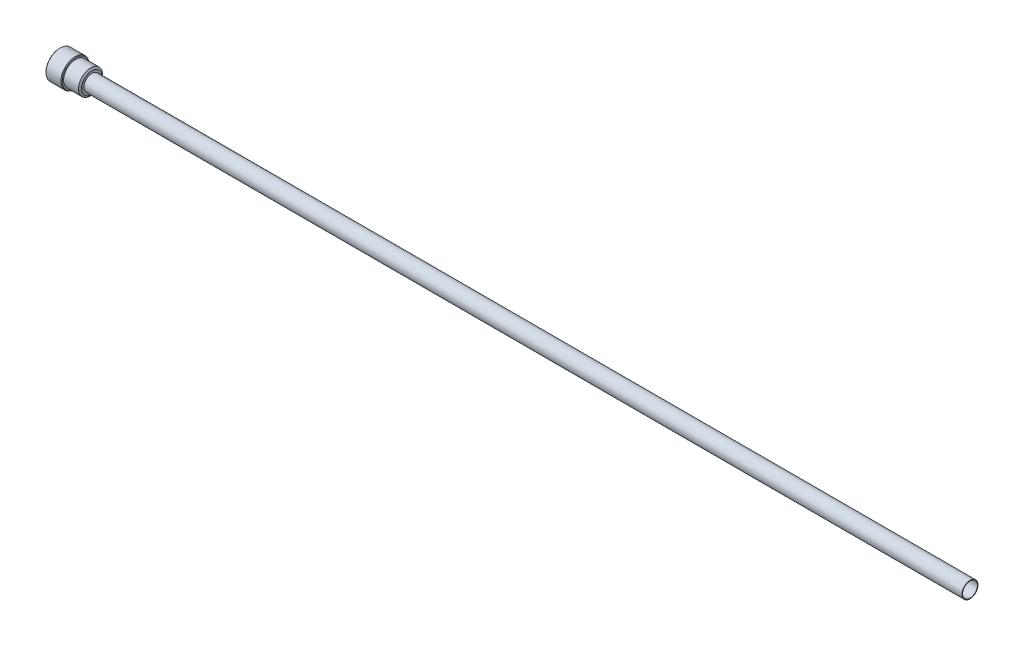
from build123d import *

# Parameters (mm, degrees)
CHAMFER3_SIZE      = 0.3
CHAMFER2_SIZE      = 0.6
CUT_EXTRUDE1_REACH = 452.109


with BuildPart() as part:
    # Sketch1 → Revolve1 (revolve)
    with BuildSketch(Plane.XY, mode=Mode.PRIVATE) as revolve1_sk:
        Polygon((16, 5.035), (15.9, 5.035), (15.34285699, 6), (8, 6), (8, 7), (0, 7), (0, 3.6576), (450, 3.6576), (450, 3.9751), (16, 3.9751), align=None)
    revolve(revolve1_sk.sketch.rotate(Axis((-22.212185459, 0, 0), (1, 0, 0)), 90), axis=Axis((-22.212185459, 0, 0), (1, 0, 0)))

    # Chamfer3
    chamfer3_edges = [part.edges().sort_by_distance(p)[0] for p in [
        (0, 0, -7),
        (8, 0, -7),
    ]]
    chamfer(chamfer3_edges, length=CHAMFER3_SIZE)

    # Sketch8 → Cut-Revolve1 (revolve, cut)
    with BuildSketch(Plane.XY, mode=Mode.PRIVATE) as cut_revolve1_sk:
        Polygon((0, 0), (0, 4), (5, 4), (7.403442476, 0), align=None)
    revolve(cut_revolve1_sk.sketch.rotate(Axis((0, 0, 0), (-1, 0, 0)), 270), axis=Axis((0, 0, 0), (-1, 0, 0)), mode=Mode.SUBTRACT)

    # Chamfer2
    chamfer2_edges = [part.edges().sort_by_distance(p)[0] for p in [
        (0, 0, -4),
    ]]
    chamfer(chamfer2_edges, length=CHAMFER2_SIZE)

    # Cut-Extrude1: up to this cone (the profile starts inside it)
    cut_extrude1_end = Plane(origin=(0, 0, 0), z_dir=(-1, 0, 0)).offset(-7.403441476) * Cone(1.664e-06, 786.095518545, 472.333838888, align=(Align.CENTER, Align.CENTER, Align.MIN), mode=Mode.PRIVATE)
    # Sketch7 → Cut-Extrude1 (cut, up to the surface)
    with BuildSketch(Plane.ZY, mode=Mode.PRIVATE) as cut_extrude1_sk1:
        Polygon((-2.309401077, 4), (-4.618802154, 0), (-2.309401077, -4), (2.309401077, -4), (4.618802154, 0), (2.309401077, 4), align=None)
    cut_extrude1_tool1 = extrude(cut_extrude1_sk1.sketch, amount=-CUT_EXTRUDE1_REACH, mode=Mode.PRIVATE) & cut_extrude1_end
    add(cut_extrude1_tool1.solids().sort_by_distance((0, 0, 0))[0], mode=Mode.SUBTRACT)


solid = part.part
